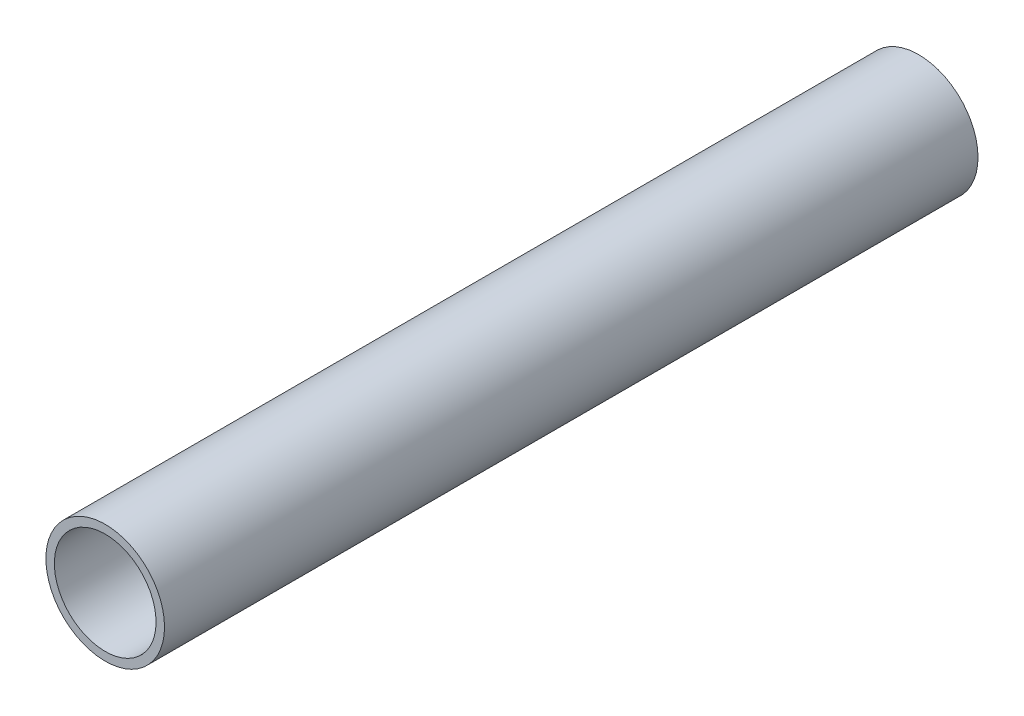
from build123d import *

# Parameters (mm, degrees)
SKETCH1_R           = 11.1125
SKETCH1_R_2         = 9.525
EXTRUDE_THIN1_DEPTH = 152.4


with BuildPart() as part:
    # Sketch1 → Extrude-Thin1 (new body)
    with BuildSketch(Plane.XY):
        Circle(SKETCH1_R)
        Circle(SKETCH1_R_2, mode=Mode.SUBTRACT)
    extrude(amount=-EXTRUDE_THIN1_DEPTH)


solid = part.part
